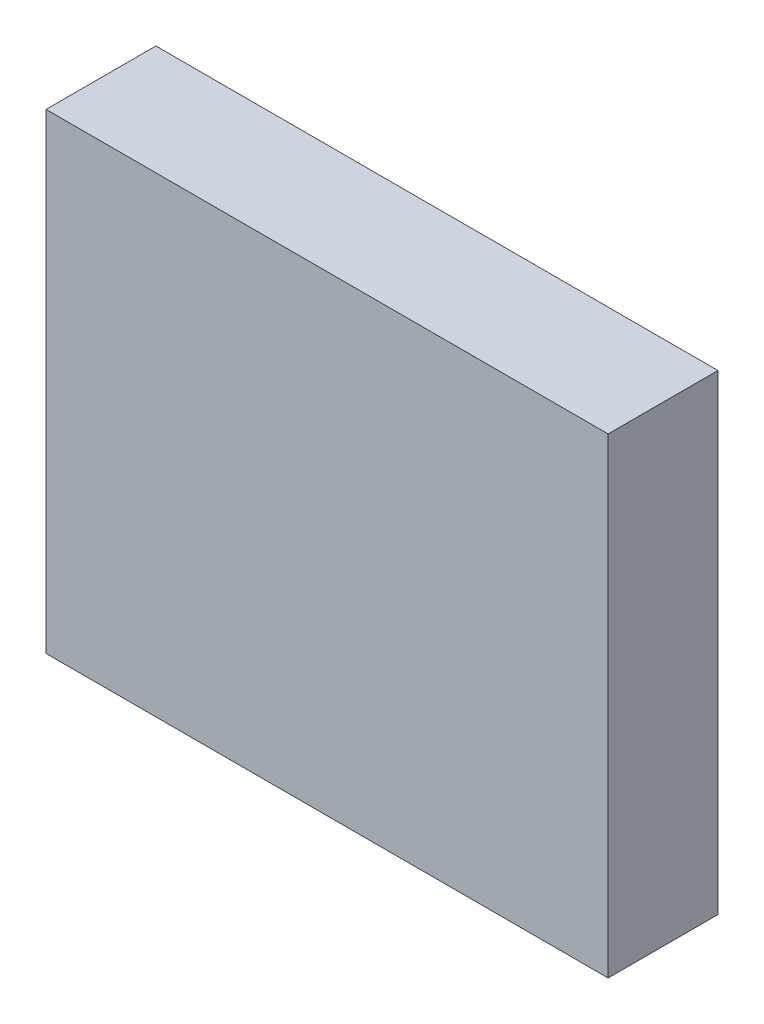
ISO-10303-21;
HEADER;
FILE_DESCRIPTION(('STEP AP214'),'2;1');
FILE_NAME('part.step','',(''),(''),'','','');
FILE_SCHEMA(('AUTOMOTIVE_DESIGN { 1 0 10303 214 1 1 1 1 }'));
ENDSEC;
DATA;
#1=APPLICATION_CONTEXT('core data for automotive mechanical design processes');
#2=APPLICATION_PROTOCOL_DEFINITION('international standard','automotive_design',2000,#1);
#3=PRODUCT_CONTEXT('',#1,'mechanical');
#4=PRODUCT('Part','Part','',(#3));
#5=PRODUCT_RELATED_PRODUCT_CATEGORY('part','',(#4));
#6=PRODUCT_DEFINITION_FORMATION('','',#4);
#7=PRODUCT_DEFINITION_CONTEXT('part definition',#1,'design');
#8=PRODUCT_DEFINITION('design','',#6,#7);
#9=PRODUCT_DEFINITION_SHAPE('','',#8);
#10=(LENGTH_UNIT() NAMED_UNIT(*) SI_UNIT(.MILLI.,.METRE.));
#11=(NAMED_UNIT(*) PLANE_ANGLE_UNIT() SI_UNIT($,.RADIAN.));
#12=(NAMED_UNIT(*) SI_UNIT($,.STERADIAN.) SOLID_ANGLE_UNIT());
#13=UNCERTAINTY_MEASURE_WITH_UNIT(LENGTH_MEASURE(1.E-05),#10,'distance_accuracy_value','');
#14=(GEOMETRIC_REPRESENTATION_CONTEXT(3) GLOBAL_UNCERTAINTY_ASSIGNED_CONTEXT((#13)) GLOBAL_UNIT_ASSIGNED_CONTEXT((#10,
#11,#12)) REPRESENTATION_CONTEXT('',''));
#15=CARTESIAN_POINT('',(0.,0.,0.));
#16=DIRECTION('',(0.,0.,1.));
#17=DIRECTION('',(1.,0.,0.));
#18=AXIS2_PLACEMENT_3D('',#15,#16,#17);
#19=CARTESIAN_POINT('',(295.347785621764,-230.732959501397,20.));
#20=DIRECTION('',(1.,0.,0.));
#21=DIRECTION('',(0.,0.,-1.));
#22=AXIS2_PLACEMENT_3D('',#19,#20,#21);
#23=PLANE('',#22);
#24=DIRECTION('',(0.,-1.,0.));
#25=VECTOR('',#24,1.);
#26=CARTESIAN_POINT('',(295.347785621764,-230.732959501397,0.));
#27=LINE('',#26,#25);
#28=CARTESIAN_POINT('',(295.347785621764,-230.732959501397,0.));
#29=VERTEX_POINT('',#28);
#30=CARTESIAN_POINT('',(295.347785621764,-316.532341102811,0.));
#31=VERTEX_POINT('',#30);
#32=EDGE_CURVE('E76',#29,#31,#27,.T.);
#33=ORIENTED_EDGE('',*,*,#32,.T.);
#34=DIRECTION('',(0.,0.,-1.));
#35=VECTOR('',#34,1.);
#36=CARTESIAN_POINT('',(295.347785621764,-316.532341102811,20.));
#37=LINE('',#36,#35);
#38=CARTESIAN_POINT('',(295.347785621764,-316.532341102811,20.));
#39=VERTEX_POINT('',#38);
#40=EDGE_CURVE('E11',#39,#31,#37,.T.);
#41=ORIENTED_EDGE('',*,*,#40,.F.);
#42=DIRECTION('',(0.,-1.,0.));
#43=VECTOR('',#42,1.);
#44=CARTESIAN_POINT('',(295.347785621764,-230.732959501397,20.));
#45=LINE('',#44,#43);
#46=CARTESIAN_POINT('',(295.347785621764,-230.732959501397,20.));
#47=VERTEX_POINT('',#46);
#48=EDGE_CURVE('E94',#47,#39,#45,.T.);
#49=ORIENTED_EDGE('',*,*,#48,.F.);
#50=DIRECTION('',(0.,0.,-1.));
#51=VECTOR('',#50,1.);
#52=CARTESIAN_POINT('',(295.347785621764,-230.732959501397,20.));
#53=LINE('',#52,#51);
#54=EDGE_CURVE('E88',#47,#29,#53,.T.);
#55=ORIENTED_EDGE('',*,*,#54,.T.);
#56=EDGE_LOOP('',(#33,#41,#49,#55));
#57=FACE_BOUND('',#56,.T.);
#58=ADVANCED_FACE('F32',(#57),#23,.F.);
#59=CARTESIAN_POINT('',(295.347785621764,-316.532341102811,20.));
#60=DIRECTION('',(0.,1.,0.));
#61=DIRECTION('',(0.,0.,1.));
#62=AXIS2_PLACEMENT_3D('',#59,#60,#61);
#63=PLANE('',#62);
#64=DIRECTION('',(1.,0.,0.));
#65=VECTOR('',#64,1.);
#66=CARTESIAN_POINT('',(295.347785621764,-316.532341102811,0.));
#67=LINE('',#66,#65);
#68=CARTESIAN_POINT('',(397.699016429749,-316.532341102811,0.));
#69=VERTEX_POINT('',#68);
#70=EDGE_CURVE('E72',#31,#69,#67,.T.);
#71=ORIENTED_EDGE('',*,*,#70,.T.);
#72=DIRECTION('',(0.,0.,-1.));
#73=VECTOR('',#72,1.);
#74=CARTESIAN_POINT('',(397.699016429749,-316.532341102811,20.));
#75=LINE('',#74,#73);
#76=CARTESIAN_POINT('',(397.699016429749,-316.532341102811,20.));
#77=VERTEX_POINT('',#76);
#78=EDGE_CURVE('E39',#77,#69,#75,.T.);
#79=ORIENTED_EDGE('',*,*,#78,.F.);
#80=DIRECTION('',(1.,0.,0.));
#81=VECTOR('',#80,1.);
#82=CARTESIAN_POINT('',(295.347785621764,-316.532341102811,20.));
#83=LINE('',#82,#81);
#84=EDGE_CURVE('E84',#39,#77,#83,.T.);
#85=ORIENTED_EDGE('',*,*,#84,.F.);
#86=ORIENTED_EDGE('',*,*,#40,.T.);
#87=EDGE_LOOP('',(#71,#79,#85,#86));
#88=FACE_BOUND('',#87,.T.);
#89=ADVANCED_FACE('F83',(#88),#63,.F.);
#90=CARTESIAN_POINT('',(397.699016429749,-230.732959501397,20.));
#91=DIRECTION('',(-1.,0.,0.));
#92=DIRECTION('',(0.,0.,1.));
#93=AXIS2_PLACEMENT_3D('',#90,#91,#92);
#94=PLANE('',#93);
#95=DIRECTION('',(0.,1.,0.));
#96=VECTOR('',#95,1.);
#97=CARTESIAN_POINT('',(397.699016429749,-230.732959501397,0.));
#98=LINE('',#97,#96);
#99=CARTESIAN_POINT('',(397.699016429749,-230.732959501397,0.));
#100=VERTEX_POINT('',#99);
#101=EDGE_CURVE('E77',#69,#100,#98,.T.);
#102=ORIENTED_EDGE('',*,*,#101,.T.);
#103=DIRECTION('',(0.,0.,-1.));
#104=VECTOR('',#103,1.);
#105=CARTESIAN_POINT('',(397.699016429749,-230.732959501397,20.));
#106=LINE('',#105,#104);
#107=CARTESIAN_POINT('',(397.699016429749,-230.732959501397,20.));
#108=VERTEX_POINT('',#107);
#109=EDGE_CURVE('E100',#108,#100,#106,.T.);
#110=ORIENTED_EDGE('',*,*,#109,.F.);
#111=DIRECTION('',(0.,1.,0.));
#112=VECTOR('',#111,1.);
#113=CARTESIAN_POINT('',(397.699016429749,-230.732959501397,20.));
#114=LINE('',#113,#112);
#115=EDGE_CURVE('E51',#77,#108,#114,.T.);
#116=ORIENTED_EDGE('',*,*,#115,.F.);
#117=ORIENTED_EDGE('',*,*,#78,.T.);
#118=EDGE_LOOP('',(#102,#110,#116,#117));
#119=FACE_BOUND('',#118,.T.);
#120=ADVANCED_FACE('F103',(#119),#94,.F.);
#121=CARTESIAN_POINT('',(295.347785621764,-230.732959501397,20.));
#122=DIRECTION('',(0.,-1.,0.));
#123=DIRECTION('',(0.,0.,-1.));
#124=AXIS2_PLACEMENT_3D('',#121,#122,#123);
#125=PLANE('',#124);
#126=DIRECTION('',(-1.,0.,0.));
#127=VECTOR('',#126,1.);
#128=CARTESIAN_POINT('',(295.347785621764,-230.732959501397,0.));
#129=LINE('',#128,#127);
#130=EDGE_CURVE('E92',#100,#29,#129,.T.);
#131=ORIENTED_EDGE('',*,*,#130,.T.);
#132=ORIENTED_EDGE('',*,*,#54,.F.);
#133=DIRECTION('',(-1.,0.,0.));
#134=VECTOR('',#133,1.);
#135=CARTESIAN_POINT('',(295.347785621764,-230.732959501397,20.));
#136=LINE('',#135,#134);
#137=EDGE_CURVE('E46',#108,#47,#136,.T.);
#138=ORIENTED_EDGE('',*,*,#137,.F.);
#139=ORIENTED_EDGE('',*,*,#109,.T.);
#140=EDGE_LOOP('',(#131,#132,#138,#139));
#141=FACE_BOUND('',#140,.T.);
#142=ADVANCED_FACE('F105',(#141),#125,.F.);
#143=CARTESIAN_POINT('',(295.347785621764,-316.532341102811,20.));
#144=DIRECTION('',(0.,0.,1.));
#145=DIRECTION('',(1.,0.,0.));
#146=AXIS2_PLACEMENT_3D('',#143,#144,#145);
#147=PLANE('',#146);
#148=ORIENTED_EDGE('',*,*,#48,.T.);
#149=ORIENTED_EDGE('',*,*,#84,.T.);
#150=ORIENTED_EDGE('',*,*,#115,.T.);
#151=ORIENTED_EDGE('',*,*,#137,.T.);
#152=EDGE_LOOP('',(#148,#149,#150,#151));
#153=FACE_BOUND('',#152,.T.);
#154=ADVANCED_FACE('F106',(#153),#147,.T.);
#155=CARTESIAN_POINT('',(295.347785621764,-316.532341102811,0.));
#156=DIRECTION('',(0.,0.,1.));
#157=DIRECTION('',(1.,0.,0.));
#158=AXIS2_PLACEMENT_3D('',#155,#156,#157);
#159=PLANE('',#158);
#160=ORIENTED_EDGE('',*,*,#32,.F.);
#161=ORIENTED_EDGE('',*,*,#130,.F.);
#162=ORIENTED_EDGE('',*,*,#101,.F.);
#163=ORIENTED_EDGE('',*,*,#70,.F.);
#164=EDGE_LOOP('',(#160,#161,#162,#163));
#165=FACE_BOUND('',#164,.T.);
#166=ADVANCED_FACE('F73',(#165),#159,.F.);
#167=CLOSED_SHELL('',(#58,#89,#120,#142,#154,#166));
#168=MANIFOLD_SOLID_BREP('B2',#167);
#169=ADVANCED_BREP_SHAPE_REPRESENTATION('',(#18,#168),#14);
#170=SHAPE_DEFINITION_REPRESENTATION(#9,#169);
ENDSEC;
END-ISO-10303-21;
